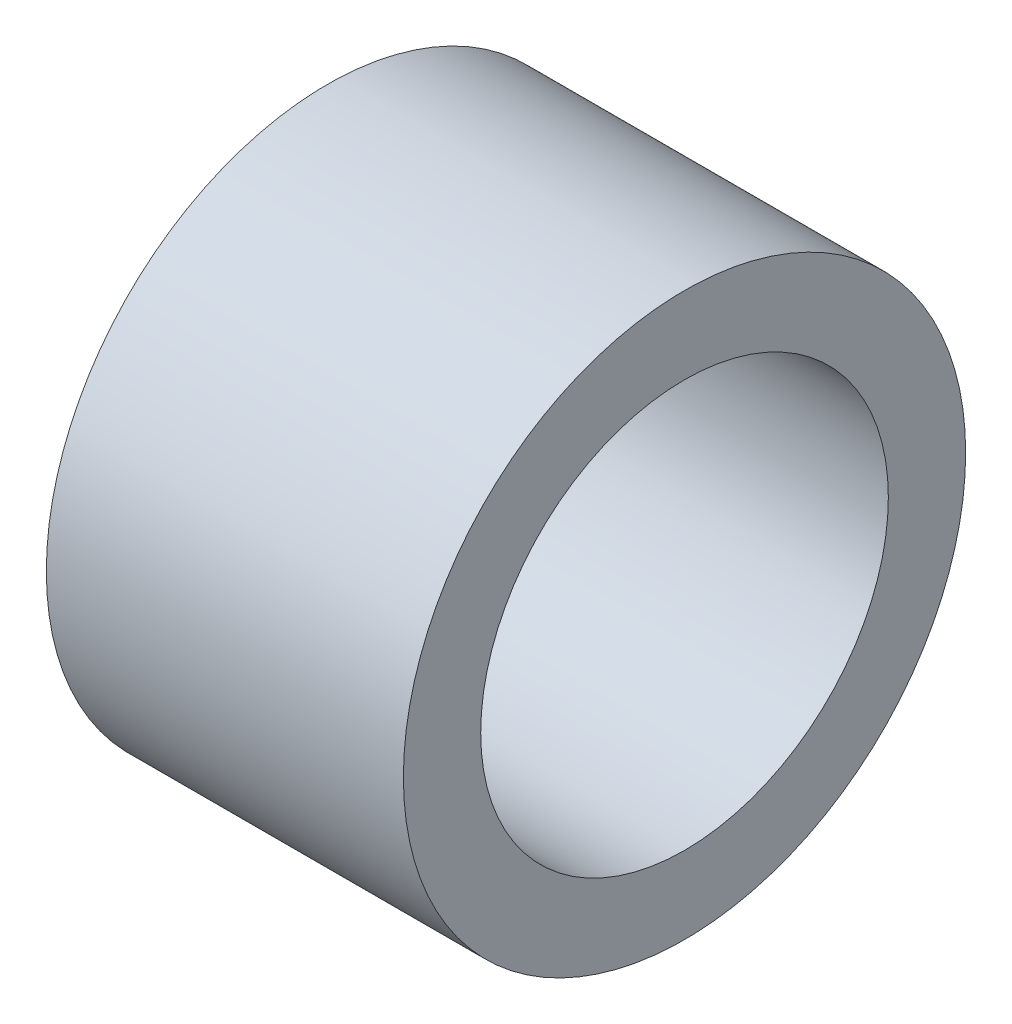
ISO-10303-21;
HEADER;
FILE_DESCRIPTION(('STEP AP214'),'2;1');
FILE_NAME('part.step','',(''),(''),'','','');
FILE_SCHEMA(('AUTOMOTIVE_DESIGN { 1 0 10303 214 1 1 1 1 }'));
ENDSEC;
DATA;
#1=APPLICATION_CONTEXT('core data for automotive mechanical design processes');
#2=APPLICATION_PROTOCOL_DEFINITION('international standard','automotive_design',2000,#1);
#3=PRODUCT_CONTEXT('',#1,'mechanical');
#4=PRODUCT('Part','Part','',(#3));
#5=PRODUCT_RELATED_PRODUCT_CATEGORY('part','',(#4));
#6=PRODUCT_DEFINITION_FORMATION('','',#4);
#7=PRODUCT_DEFINITION_CONTEXT('part definition',#1,'design');
#8=PRODUCT_DEFINITION('design','',#6,#7);
#9=PRODUCT_DEFINITION_SHAPE('','',#8);
#10=(LENGTH_UNIT() NAMED_UNIT(*) SI_UNIT(.MILLI.,.METRE.));
#11=(NAMED_UNIT(*) PLANE_ANGLE_UNIT() SI_UNIT($,.RADIAN.));
#12=(NAMED_UNIT(*) SI_UNIT($,.STERADIAN.) SOLID_ANGLE_UNIT());
#13=UNCERTAINTY_MEASURE_WITH_UNIT(LENGTH_MEASURE(1.E-05),#10,'distance_accuracy_value','');
#14=(GEOMETRIC_REPRESENTATION_CONTEXT(3) GLOBAL_UNCERTAINTY_ASSIGNED_CONTEXT((#13)) GLOBAL_UNIT_ASSIGNED_CONTEXT((#10,
#11,#12)) REPRESENTATION_CONTEXT('',''));
#15=CARTESIAN_POINT('',(0.,0.,0.));
#16=DIRECTION('',(0.,0.,1.));
#17=DIRECTION('',(1.,0.,0.));
#18=AXIS2_PLACEMENT_3D('',#15,#16,#17);
#19=CARTESIAN_POINT('',(2.54,0.,0.));
#20=DIRECTION('',(1.,0.,0.));
#21=DIRECTION('',(0.,0.,-1.));
#22=AXIS2_PLACEMENT_3D('',#19,#20,#21);
#23=PLANE('',#22);
#24=CARTESIAN_POINT('',(2.54,0.,0.));
#25=DIRECTION('',(1.,0.,0.));
#26=DIRECTION('',(0.,0.,-1.));
#27=AXIS2_PLACEMENT_3D('',#24,#25,#26);
#28=CIRCLE('',#27,2.);
#29=CARTESIAN_POINT('',(2.54,0.,-2.));
#30=VERTEX_POINT('',#29);
#31=EDGE_CURVE('E10',#30,#30,#28,.T.);
#32=ORIENTED_EDGE('',*,*,#31,.T.);
#33=EDGE_LOOP('',(#32));
#34=FACE_BOUND('',#33,.T.);
#35=CARTESIAN_POINT('',(2.54,0.,0.));
#36=DIRECTION('',(1.,0.,0.));
#37=DIRECTION('',(0.,0.,-1.));
#38=AXIS2_PLACEMENT_3D('',#35,#36,#37);
#39=CIRCLE('',#38,1.45);
#40=CARTESIAN_POINT('',(2.54,0.,-1.45));
#41=VERTEX_POINT('',#40);
#42=EDGE_CURVE('E55',#41,#41,#39,.T.);
#43=ORIENTED_EDGE('',*,*,#42,.F.);
#44=EDGE_LOOP('',(#43));
#45=FACE_BOUND('',#44,.T.);
#46=ADVANCED_FACE('F41',(#34,#45),#23,.T.);
#47=CARTESIAN_POINT('',(0.,0.,0.));
#48=DIRECTION('',(1.,0.,0.));
#49=DIRECTION('',(0.,0.,-1.));
#50=AXIS2_PLACEMENT_3D('',#47,#48,#49);
#51=PLANE('',#50);
#52=CARTESIAN_POINT('',(0.,0.,0.));
#53=DIRECTION('',(1.,0.,0.));
#54=DIRECTION('',(0.,0.,-1.));
#55=AXIS2_PLACEMENT_3D('',#52,#53,#54);
#56=CIRCLE('',#55,2.);
#57=CARTESIAN_POINT('',(0.,0.,-2.));
#58=VERTEX_POINT('',#57);
#59=EDGE_CURVE('E44',#58,#58,#56,.T.);
#60=ORIENTED_EDGE('',*,*,#59,.F.);
#61=EDGE_LOOP('',(#60));
#62=FACE_BOUND('',#61,.T.);
#63=CARTESIAN_POINT('',(0.,0.,0.));
#64=DIRECTION('',(1.,0.,0.));
#65=DIRECTION('',(0.,0.,-1.));
#66=AXIS2_PLACEMENT_3D('',#63,#64,#65);
#67=CIRCLE('',#66,1.45);
#68=CARTESIAN_POINT('',(0.,0.,-1.45));
#69=VERTEX_POINT('',#68);
#70=EDGE_CURVE('E53',#69,#69,#67,.T.);
#71=ORIENTED_EDGE('',*,*,#70,.T.);
#72=EDGE_LOOP('',(#71));
#73=FACE_BOUND('',#72,.T.);
#74=ADVANCED_FACE('F61',(#62,#73),#51,.F.);
#75=CARTESIAN_POINT('',(2.54,0.,0.));
#76=DIRECTION('',(-1.,0.,0.));
#77=DIRECTION('',(0.,0.,1.));
#78=AXIS2_PLACEMENT_3D('',#75,#76,#77);
#79=CYLINDRICAL_SURFACE('',#78,2.);
#80=ORIENTED_EDGE('',*,*,#31,.F.);
#81=EDGE_LOOP('',(#80));
#82=FACE_BOUND('',#81,.T.);
#83=ORIENTED_EDGE('',*,*,#59,.T.);
#84=EDGE_LOOP('',(#83));
#85=FACE_BOUND('',#84,.T.);
#86=ADVANCED_FACE('F43',(#82,#85),#79,.T.);
#87=CARTESIAN_POINT('',(2.54,0.,0.));
#88=DIRECTION('',(-1.,0.,0.));
#89=DIRECTION('',(0.,0.,1.));
#90=AXIS2_PLACEMENT_3D('',#87,#88,#89);
#91=CYLINDRICAL_SURFACE('',#90,1.45);
#92=ORIENTED_EDGE('',*,*,#42,.T.);
#93=EDGE_LOOP('',(#92));
#94=FACE_BOUND('',#93,.T.);
#95=ORIENTED_EDGE('',*,*,#70,.F.);
#96=EDGE_LOOP('',(#95));
#97=FACE_BOUND('',#96,.T.);
#98=ADVANCED_FACE('F58',(#94,#97),#91,.F.);
#99=CLOSED_SHELL('',(#46,#74,#86,#98));
#100=MANIFOLD_SOLID_BREP('B2',#99);
#101=ADVANCED_BREP_SHAPE_REPRESENTATION('',(#18,#100),#14);
#102=SHAPE_DEFINITION_REPRESENTATION(#9,#101);
ENDSEC;
END-ISO-10303-21;
